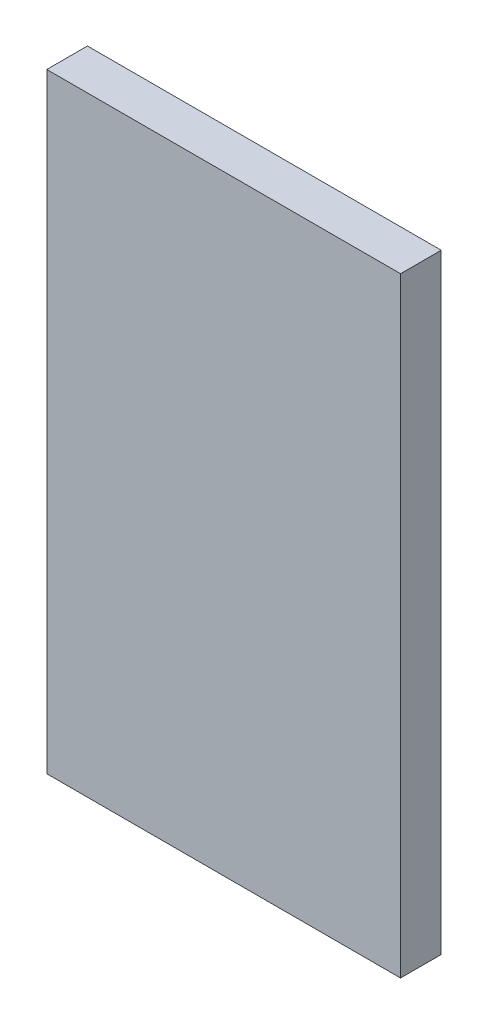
ISO-10303-21;
HEADER;
FILE_DESCRIPTION(('STEP AP214'),'2;1');
FILE_NAME('part.step','',(''),(''),'','','');
FILE_SCHEMA(('AUTOMOTIVE_DESIGN { 1 0 10303 214 1 1 1 1 }'));
ENDSEC;
DATA;
#1=APPLICATION_CONTEXT('core data for automotive mechanical design processes');
#2=APPLICATION_PROTOCOL_DEFINITION('international standard','automotive_design',2000,#1);
#3=PRODUCT_CONTEXT('',#1,'mechanical');
#4=PRODUCT('Part','Part','',(#3));
#5=PRODUCT_RELATED_PRODUCT_CATEGORY('part','',(#4));
#6=PRODUCT_DEFINITION_FORMATION('','',#4);
#7=PRODUCT_DEFINITION_CONTEXT('part definition',#1,'design');
#8=PRODUCT_DEFINITION('design','',#6,#7);
#9=PRODUCT_DEFINITION_SHAPE('','',#8);
#10=(LENGTH_UNIT() NAMED_UNIT(*) SI_UNIT(.MILLI.,.METRE.));
#11=(NAMED_UNIT(*) PLANE_ANGLE_UNIT() SI_UNIT($,.RADIAN.));
#12=(NAMED_UNIT(*) SI_UNIT($,.STERADIAN.) SOLID_ANGLE_UNIT());
#13=UNCERTAINTY_MEASURE_WITH_UNIT(LENGTH_MEASURE(1.E-05),#10,'distance_accuracy_value','');
#14=(GEOMETRIC_REPRESENTATION_CONTEXT(3) GLOBAL_UNCERTAINTY_ASSIGNED_CONTEXT((#13)) GLOBAL_UNIT_ASSIGNED_CONTEXT((#10,
#11,#12)) REPRESENTATION_CONTEXT('',''));
#15=CARTESIAN_POINT('',(0.,0.,0.));
#16=DIRECTION('',(0.,0.,1.));
#17=DIRECTION('',(1.,0.,0.));
#18=AXIS2_PLACEMENT_3D('',#15,#16,#17);
#19=CARTESIAN_POINT('',(0.,0.,20.));
#20=DIRECTION('',(0.,0.,1.));
#21=DIRECTION('',(1.,0.,0.));
#22=AXIS2_PLACEMENT_3D('',#19,#20,#21);
#23=PLANE('',#22);
#24=DIRECTION('',(1.,0.,0.));
#25=VECTOR('',#24,1.);
#26=CARTESIAN_POINT('',(-87.,-150.,20.));
#27=LINE('',#26,#25);
#28=CARTESIAN_POINT('',(-87.,-150.,20.));
#29=VERTEX_POINT('',#28);
#30=CARTESIAN_POINT('',(87.,-150.,20.));
#31=VERTEX_POINT('',#30);
#32=EDGE_CURVE('E84',#29,#31,#27,.T.);
#33=ORIENTED_EDGE('',*,*,#32,.T.);
#34=DIRECTION('',(0.,1.,0.));
#35=VECTOR('',#34,1.);
#36=CARTESIAN_POINT('',(87.,-150.,20.));
#37=LINE('',#36,#35);
#38=CARTESIAN_POINT('',(87.,150.,20.));
#39=VERTEX_POINT('',#38);
#40=EDGE_CURVE('E70',#31,#39,#37,.T.);
#41=ORIENTED_EDGE('',*,*,#40,.T.);
#42=DIRECTION('',(-1.,0.,0.));
#43=VECTOR('',#42,1.);
#44=CARTESIAN_POINT('',(87.,150.,20.));
#45=LINE('',#44,#43);
#46=CARTESIAN_POINT('',(-87.,150.,20.));
#47=VERTEX_POINT('',#46);
#48=EDGE_CURVE('E111',#39,#47,#45,.T.);
#49=ORIENTED_EDGE('',*,*,#48,.T.);
#50=DIRECTION('',(0.,-1.,0.));
#51=VECTOR('',#50,1.);
#52=CARTESIAN_POINT('',(-87.,150.,20.));
#53=LINE('',#52,#51);
#54=EDGE_CURVE('E10',#47,#29,#53,.T.);
#55=ORIENTED_EDGE('',*,*,#54,.T.);
#56=EDGE_LOOP('',(#33,#41,#49,#55));
#57=FACE_BOUND('',#56,.T.);
#58=ADVANCED_FACE('F16',(#57),#23,.T.);
#59=CARTESIAN_POINT('',(0.,0.,0.));
#60=DIRECTION('',(0.,0.,1.));
#61=DIRECTION('',(1.,0.,0.));
#62=AXIS2_PLACEMENT_3D('',#59,#60,#61);
#63=PLANE('',#62);
#64=DIRECTION('',(0.,-1.,0.));
#65=VECTOR('',#64,1.);
#66=CARTESIAN_POINT('',(-87.,150.,0.));
#67=LINE('',#66,#65);
#68=CARTESIAN_POINT('',(-87.,150.,0.));
#69=VERTEX_POINT('',#68);
#70=CARTESIAN_POINT('',(-87.,-150.,0.));
#71=VERTEX_POINT('',#70);
#72=EDGE_CURVE('E19',#69,#71,#67,.T.);
#73=ORIENTED_EDGE('',*,*,#72,.F.);
#74=DIRECTION('',(-1.,0.,0.));
#75=VECTOR('',#74,1.);
#76=CARTESIAN_POINT('',(87.,150.,0.));
#77=LINE('',#76,#75);
#78=CARTESIAN_POINT('',(87.,150.,0.));
#79=VERTEX_POINT('',#78);
#80=EDGE_CURVE('E81',#79,#69,#77,.T.);
#81=ORIENTED_EDGE('',*,*,#80,.F.);
#82=DIRECTION('',(0.,1.,0.));
#83=VECTOR('',#82,1.);
#84=CARTESIAN_POINT('',(87.,-150.,0.));
#85=LINE('',#84,#83);
#86=CARTESIAN_POINT('',(87.,-150.,0.));
#87=VERTEX_POINT('',#86);
#88=EDGE_CURVE('E101',#87,#79,#85,.T.);
#89=ORIENTED_EDGE('',*,*,#88,.F.);
#90=DIRECTION('',(1.,0.,0.));
#91=VECTOR('',#90,1.);
#92=CARTESIAN_POINT('',(-87.,-150.,0.));
#93=LINE('',#92,#91);
#94=EDGE_CURVE('E91',#71,#87,#93,.T.);
#95=ORIENTED_EDGE('',*,*,#94,.F.);
#96=EDGE_LOOP('',(#73,#81,#89,#95));
#97=FACE_BOUND('',#96,.T.);
#98=ADVANCED_FACE('F118',(#97),#63,.F.);
#99=CARTESIAN_POINT('',(-87.,150.,0.));
#100=DIRECTION('',(1.,0.,0.));
#101=DIRECTION('',(0.,1.,0.));
#102=AXIS2_PLACEMENT_3D('',#99,#100,#101);
#103=PLANE('',#102);
#104=ORIENTED_EDGE('',*,*,#72,.T.);
#105=DIRECTION('',(0.,0.,1.));
#106=VECTOR('',#105,1.);
#107=CARTESIAN_POINT('',(-87.,-150.,0.));
#108=LINE('',#107,#106);
#109=EDGE_CURVE('E88',#71,#29,#108,.T.);
#110=ORIENTED_EDGE('',*,*,#109,.T.);
#111=ORIENTED_EDGE('',*,*,#54,.F.);
#112=DIRECTION('',(0.,0.,1.));
#113=VECTOR('',#112,1.);
#114=CARTESIAN_POINT('',(-87.,150.,0.));
#115=LINE('',#114,#113);
#116=EDGE_CURVE('E107',#69,#47,#115,.T.);
#117=ORIENTED_EDGE('',*,*,#116,.F.);
#118=EDGE_LOOP('',(#104,#110,#111,#117));
#119=FACE_BOUND('',#118,.T.);
#120=ADVANCED_FACE('F117',(#119),#103,.F.);
#121=CARTESIAN_POINT('',(87.,150.,0.));
#122=DIRECTION('',(0.,-1.,0.));
#123=DIRECTION('',(0.,0.,-1.));
#124=AXIS2_PLACEMENT_3D('',#121,#122,#123);
#125=PLANE('',#124);
#126=ORIENTED_EDGE('',*,*,#80,.T.);
#127=ORIENTED_EDGE('',*,*,#116,.T.);
#128=ORIENTED_EDGE('',*,*,#48,.F.);
#129=DIRECTION('',(0.,0.,1.));
#130=VECTOR('',#129,1.);
#131=CARTESIAN_POINT('',(87.,150.,0.));
#132=LINE('',#131,#130);
#133=EDGE_CURVE('E78',#79,#39,#132,.T.);
#134=ORIENTED_EDGE('',*,*,#133,.F.);
#135=EDGE_LOOP('',(#126,#127,#128,#134));
#136=FACE_BOUND('',#135,.T.);
#137=ADVANCED_FACE('F120',(#136),#125,.F.);
#138=CARTESIAN_POINT('',(87.,-150.,0.));
#139=DIRECTION('',(-1.,0.,0.));
#140=DIRECTION('',(0.,0.,1.));
#141=AXIS2_PLACEMENT_3D('',#138,#139,#140);
#142=PLANE('',#141);
#143=ORIENTED_EDGE('',*,*,#88,.T.);
#144=ORIENTED_EDGE('',*,*,#133,.T.);
#145=ORIENTED_EDGE('',*,*,#40,.F.);
#146=DIRECTION('',(0.,0.,1.));
#147=VECTOR('',#146,1.);
#148=CARTESIAN_POINT('',(87.,-150.,0.));
#149=LINE('',#148,#147);
#150=EDGE_CURVE('E75',#87,#31,#149,.T.);
#151=ORIENTED_EDGE('',*,*,#150,.F.);
#152=EDGE_LOOP('',(#143,#144,#145,#151));
#153=FACE_BOUND('',#152,.T.);
#154=ADVANCED_FACE('F73',(#153),#142,.F.);
#155=CARTESIAN_POINT('',(-87.,-150.,0.));
#156=DIRECTION('',(0.,1.,0.));
#157=DIRECTION('',(1.,0.,0.));
#158=AXIS2_PLACEMENT_3D('',#155,#156,#157);
#159=PLANE('',#158);
#160=ORIENTED_EDGE('',*,*,#94,.T.);
#161=ORIENTED_EDGE('',*,*,#150,.T.);
#162=ORIENTED_EDGE('',*,*,#32,.F.);
#163=ORIENTED_EDGE('',*,*,#109,.F.);
#164=EDGE_LOOP('',(#160,#161,#162,#163));
#165=FACE_BOUND('',#164,.T.);
#166=ADVANCED_FACE('F90',(#165),#159,.F.);
#167=CLOSED_SHELL('',(#58,#98,#120,#137,#154,#166));
#168=MANIFOLD_SOLID_BREP('B1',#167);
#169=ADVANCED_BREP_SHAPE_REPRESENTATION('',(#18,#168),#14);
#170=SHAPE_DEFINITION_REPRESENTATION(#9,#169);
ENDSEC;
END-ISO-10303-21;
